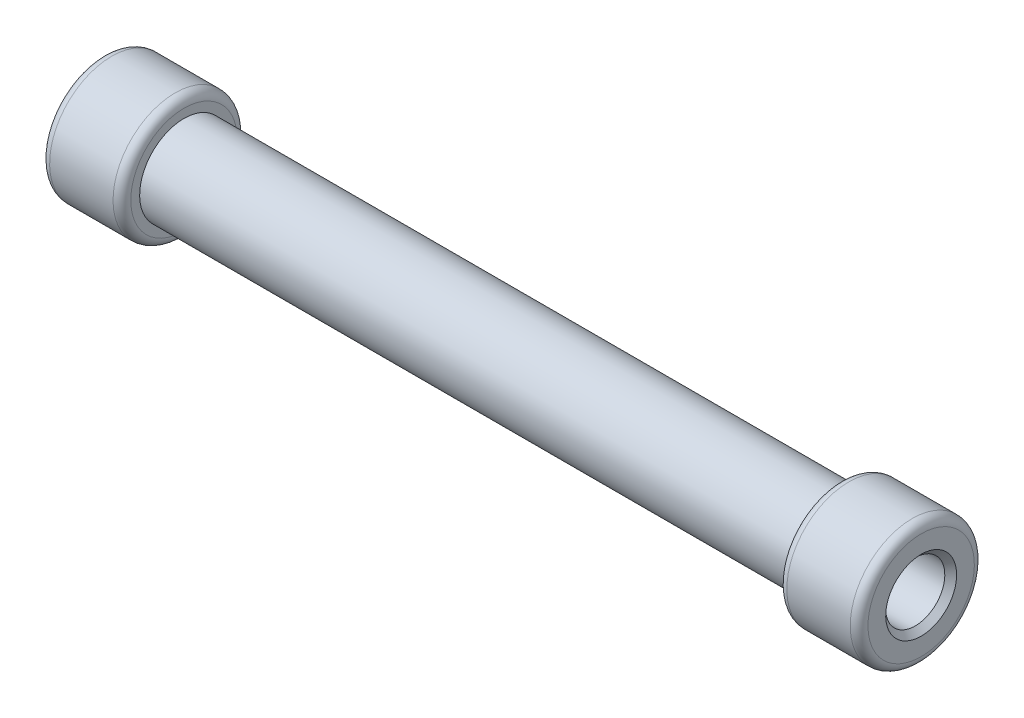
ISO-10303-21;
HEADER;
FILE_DESCRIPTION(('STEP AP214'),'2;1');
FILE_NAME('part.step','',(''),(''),'','','');
FILE_SCHEMA(('AUTOMOTIVE_DESIGN { 1 0 10303 214 1 1 1 1 }'));
ENDSEC;
DATA;
#1=APPLICATION_CONTEXT('core data for automotive mechanical design processes');
#2=APPLICATION_PROTOCOL_DEFINITION('international standard','automotive_design',2000,#1);
#3=PRODUCT_CONTEXT('',#1,'mechanical');
#4=PRODUCT('Part','Part','',(#3));
#5=PRODUCT_RELATED_PRODUCT_CATEGORY('part','',(#4));
#6=PRODUCT_DEFINITION_FORMATION('','',#4);
#7=PRODUCT_DEFINITION_CONTEXT('part definition',#1,'design');
#8=PRODUCT_DEFINITION('design','',#6,#7);
#9=PRODUCT_DEFINITION_SHAPE('','',#8);
#10=(LENGTH_UNIT() NAMED_UNIT(*) SI_UNIT(.MILLI.,.METRE.));
#11=(NAMED_UNIT(*) PLANE_ANGLE_UNIT() SI_UNIT($,.RADIAN.));
#12=(NAMED_UNIT(*) SI_UNIT($,.STERADIAN.) SOLID_ANGLE_UNIT());
#13=UNCERTAINTY_MEASURE_WITH_UNIT(LENGTH_MEASURE(1.E-05),#10,'distance_accuracy_value','');
#14=(GEOMETRIC_REPRESENTATION_CONTEXT(3) GLOBAL_UNCERTAINTY_ASSIGNED_CONTEXT((#13)) GLOBAL_UNIT_ASSIGNED_CONTEXT((#10,
#11,#12)) REPRESENTATION_CONTEXT('',''));
#15=CARTESIAN_POINT('',(0.,0.,0.));
#16=DIRECTION('',(0.,0.,1.));
#17=DIRECTION('',(1.,0.,0.));
#18=AXIS2_PLACEMENT_3D('',#15,#16,#17);
#19=CARTESIAN_POINT('',(48.1,0.,4.33333333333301));
#20=DIRECTION('',(-1.,0.,0.));
#21=DIRECTION('',(0.,-1.,0.));
#22=AXIS2_PLACEMENT_3D('',#19,#20,#21);
#23=PLANE('',#22);
#24=CARTESIAN_POINT('',(48.1,0.,0.));
#25=DIRECTION('',(1.,0.,0.));
#26=DIRECTION('',(0.,1.,0.));
#27=AXIS2_PLACEMENT_3D('',#24,#25,#26);
#28=CIRCLE('',#27,4.333333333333);
#29=CARTESIAN_POINT('',(48.1,4.333333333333,0.));
#30=VERTEX_POINT('',#29);
#31=EDGE_CURVE('E65',#30,#30,#28,.T.);
#32=ORIENTED_EDGE('',*,*,#31,.T.);
#33=EDGE_LOOP('',(#32));
#34=FACE_BOUND('',#33,.T.);
#35=ADVANCED_FACE('F12',(#34),#23,.F.);
#36=CARTESIAN_POINT('',(60.,0.,0.));
#37=DIRECTION('',(1.,0.,0.));
#38=DIRECTION('',(0.,1.,0.));
#39=AXIS2_PLACEMENT_3D('',#36,#37,#38);
#40=CYLINDRICAL_SURFACE('',#39,4.333333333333);
#41=ORIENTED_EDGE('',*,*,#31,.F.);
#42=EDGE_LOOP('',(#41));
#43=FACE_BOUND('',#42,.T.);
#44=CARTESIAN_POINT('',(59.133333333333,0.,0.));
#45=DIRECTION('',(1.,0.,0.));
#46=DIRECTION('',(0.,1.,0.));
#47=AXIS2_PLACEMENT_3D('',#44,#45,#46);
#48=CIRCLE('',#47,4.333333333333);
#49=CARTESIAN_POINT('',(59.133333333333,4.333333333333,0.));
#50=VERTEX_POINT('',#49);
#51=EDGE_CURVE('E62',#50,#50,#48,.T.);
#52=ORIENTED_EDGE('',*,*,#51,.T.);
#53=EDGE_LOOP('',(#52));
#54=FACE_BOUND('',#53,.T.);
#55=ADVANCED_FACE('F70',(#43,#54),#40,.F.);
#56=CARTESIAN_POINT('',(60.,0.,0.));
#57=DIRECTION('',(1.,0.,0.));
#58=DIRECTION('',(0.,1.,0.));
#59=AXIS2_PLACEMENT_3D('',#56,#57,#58);
#60=CONICAL_SURFACE('',#59,5.2,0.785398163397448);
#61=ORIENTED_EDGE('',*,*,#51,.F.);
#62=EDGE_LOOP('',(#61));
#63=FACE_BOUND('',#62,.T.);
#64=CARTESIAN_POINT('',(60.,0.,0.));
#65=DIRECTION('',(1.,0.,0.));
#66=DIRECTION('',(0.,1.,0.));
#67=AXIS2_PLACEMENT_3D('',#64,#65,#66);
#68=CIRCLE('',#67,5.2);
#69=CARTESIAN_POINT('',(60.,5.2,0.));
#70=VERTEX_POINT('',#69);
#71=EDGE_CURVE('E59',#70,#70,#68,.T.);
#72=ORIENTED_EDGE('',*,*,#71,.T.);
#73=EDGE_LOOP('',(#72));
#74=FACE_BOUND('',#73,.T.);
#75=ADVANCED_FACE('F73',(#63,#74),#60,.F.);
#76=CARTESIAN_POINT('',(60.,0.,7.8));
#77=DIRECTION('',(-1.,0.,0.));
#78=DIRECTION('',(0.,-1.,0.));
#79=AXIS2_PLACEMENT_3D('',#76,#77,#78);
#80=PLANE('',#79);
#81=ORIENTED_EDGE('',*,*,#71,.F.);
#82=EDGE_LOOP('',(#81));
#83=FACE_BOUND('',#82,.T.);
#84=CARTESIAN_POINT('',(60.,0.,0.));
#85=DIRECTION('',(1.,0.,0.));
#86=DIRECTION('',(0.,1.,0.));
#87=AXIS2_PLACEMENT_3D('',#84,#85,#86);
#88=CIRCLE('',#87,7.80000000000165);
#89=CARTESIAN_POINT('',(60.,7.80000000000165,0.));
#90=VERTEX_POINT('',#89);
#91=EDGE_CURVE('E56',#90,#90,#88,.T.);
#92=ORIENTED_EDGE('',*,*,#91,.T.);
#93=EDGE_LOOP('',(#92));
#94=FACE_BOUND('',#93,.T.);
#95=ADVANCED_FACE('F79',(#83,#94),#80,.F.);
#96=CARTESIAN_POINT('',(58.7000000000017,0.,0.));
#97=DIRECTION('',(1.,0.,0.));
#98=DIRECTION('',(0.,1.,0.));
#99=AXIS2_PLACEMENT_3D('',#96,#97,#98);
#100=TOROIDAL_SURFACE('',#99,7.80000000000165,1.29999999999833);
#101=CARTESIAN_POINT('',(58.7,0.,0.));
#102=DIRECTION('',(1.,0.,0.));
#103=DIRECTION('',(0.,1.,0.));
#104=AXIS2_PLACEMENT_3D('',#101,#102,#103);
#105=CIRCLE('',#104,9.1);
#106=CARTESIAN_POINT('',(58.7,9.1,0.));
#107=VERTEX_POINT('',#106);
#108=EDGE_CURVE('E53',#107,#107,#105,.T.);
#109=ORIENTED_EDGE('',*,*,#108,.T.);
#110=EDGE_LOOP('',(#109));
#111=FACE_BOUND('',#110,.T.);
#112=ORIENTED_EDGE('',*,*,#91,.F.);
#113=EDGE_LOOP('',(#112));
#114=FACE_BOUND('',#113,.T.);
#115=ADVANCED_FACE('F85',(#111,#114),#100,.T.);
#116=CARTESIAN_POINT('',(60.,0.,0.));
#117=DIRECTION('',(1.,0.,0.));
#118=DIRECTION('',(0.,1.,0.));
#119=AXIS2_PLACEMENT_3D('',#116,#117,#118);
#120=CYLINDRICAL_SURFACE('',#119,9.1);
#121=ORIENTED_EDGE('',*,*,#108,.F.);
#122=EDGE_LOOP('',(#121));
#123=FACE_BOUND('',#122,.T.);
#124=CARTESIAN_POINT('',(49.3999999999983,0.,0.));
#125=DIRECTION('',(1.,0.,0.));
#126=DIRECTION('',(0.,1.,0.));
#127=AXIS2_PLACEMENT_3D('',#124,#125,#126);
#128=CIRCLE('',#127,9.1);
#129=CARTESIAN_POINT('',(49.3999999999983,9.1,0.));
#130=VERTEX_POINT('',#129);
#131=EDGE_CURVE('E50',#130,#130,#128,.T.);
#132=ORIENTED_EDGE('',*,*,#131,.T.);
#133=EDGE_LOOP('',(#132));
#134=FACE_BOUND('',#133,.T.);
#135=ADVANCED_FACE('F90',(#123,#134),#120,.T.);
#136=CARTESIAN_POINT('',(49.3999999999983,0.,0.));
#137=DIRECTION('',(1.,0.,0.));
#138=DIRECTION('',(0.,1.,0.));
#139=AXIS2_PLACEMENT_3D('',#136,#137,#138);
#140=TOROIDAL_SURFACE('',#139,7.80000000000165,1.29999999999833);
#141=CARTESIAN_POINT('',(48.1,0.,0.));
#142=DIRECTION('',(1.,0.,0.));
#143=DIRECTION('',(0.,1.,0.));
#144=AXIS2_PLACEMENT_3D('',#141,#142,#143);
#145=CIRCLE('',#144,7.8);
#146=CARTESIAN_POINT('',(48.1,7.8,0.));
#147=VERTEX_POINT('',#146);
#148=EDGE_CURVE('E47',#147,#147,#145,.T.);
#149=ORIENTED_EDGE('',*,*,#148,.T.);
#150=EDGE_LOOP('',(#149));
#151=FACE_BOUND('',#150,.T.);
#152=ORIENTED_EDGE('',*,*,#131,.F.);
#153=EDGE_LOOP('',(#152));
#154=FACE_BOUND('',#153,.T.);
#155=ADVANCED_FACE('F98',(#151,#154),#140,.T.);
#156=CARTESIAN_POINT('',(48.1,0.,6.5));
#157=DIRECTION('',(1.,0.,0.));
#158=DIRECTION('',(0.,1.,0.));
#159=AXIS2_PLACEMENT_3D('',#156,#157,#158);
#160=PLANE('',#159);
#161=ORIENTED_EDGE('',*,*,#148,.F.);
#162=EDGE_LOOP('',(#161));
#163=FACE_BOUND('',#162,.T.);
#164=CARTESIAN_POINT('',(48.1,0.,0.));
#165=DIRECTION('',(1.,0.,0.));
#166=DIRECTION('',(0.,1.,0.));
#167=AXIS2_PLACEMENT_3D('',#164,#165,#166);
#168=CIRCLE('',#167,6.5);
#169=CARTESIAN_POINT('',(48.1,6.5,0.));
#170=VERTEX_POINT('',#169);
#171=EDGE_CURVE('E44',#170,#170,#168,.T.);
#172=ORIENTED_EDGE('',*,*,#171,.T.);
#173=EDGE_LOOP('',(#172));
#174=FACE_BOUND('',#173,.T.);
#175=ADVANCED_FACE('F145',(#163,#174),#160,.F.);
#176=CARTESIAN_POINT('',(-48.1,0.,0.));
#177=DIRECTION('',(1.,0.,0.));
#178=DIRECTION('',(0.,1.,0.));
#179=AXIS2_PLACEMENT_3D('',#176,#177,#178);
#180=PLANE('',#179);
#181=CARTESIAN_POINT('',(-48.1,0.,0.));
#182=DIRECTION('',(1.,0.,0.));
#183=DIRECTION('',(0.,1.,0.));
#184=AXIS2_PLACEMENT_3D('',#181,#182,#183);
#185=CIRCLE('',#184,4.333333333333);
#186=CARTESIAN_POINT('',(-48.1,4.333333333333,0.));
#187=VERTEX_POINT('',#186);
#188=EDGE_CURVE('E8',#187,#187,#185,.T.);
#189=ORIENTED_EDGE('',*,*,#188,.F.);
#190=EDGE_LOOP('',(#189));
#191=FACE_BOUND('',#190,.T.);
#192=ADVANCED_FACE('F14',(#191),#180,.F.);
#193=CARTESIAN_POINT('',(60.,0.,0.));
#194=DIRECTION('',(1.,0.,0.));
#195=DIRECTION('',(0.,1.,0.));
#196=AXIS2_PLACEMENT_3D('',#193,#194,#195);
#197=CYLINDRICAL_SURFACE('',#196,4.333333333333);
#198=CARTESIAN_POINT('',(-59.133333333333,0.,0.));
#199=DIRECTION('',(1.,0.,0.));
#200=DIRECTION('',(0.,1.,0.));
#201=AXIS2_PLACEMENT_3D('',#198,#199,#200);
#202=CIRCLE('',#201,4.333333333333);
#203=CARTESIAN_POINT('',(-59.133333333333,4.333333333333,0.));
#204=VERTEX_POINT('',#203);
#205=EDGE_CURVE('E19',#204,#204,#202,.T.);
#206=ORIENTED_EDGE('',*,*,#205,.F.);
#207=EDGE_LOOP('',(#206));
#208=FACE_BOUND('',#207,.T.);
#209=ORIENTED_EDGE('',*,*,#188,.T.);
#210=EDGE_LOOP('',(#209));
#211=FACE_BOUND('',#210,.T.);
#212=ADVANCED_FACE('F161',(#208,#211),#197,.F.);
#213=CARTESIAN_POINT('',(-59.133333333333,0.,0.));
#214=DIRECTION('',(-1.,0.,0.));
#215=DIRECTION('',(0.,-1.,0.));
#216=AXIS2_PLACEMENT_3D('',#213,#214,#215);
#217=CONICAL_SURFACE('',#216,4.333333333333,0.785398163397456);
#218=CARTESIAN_POINT('',(-60.,0.,0.));
#219=DIRECTION('',(1.,0.,0.));
#220=DIRECTION('',(0.,1.,0.));
#221=AXIS2_PLACEMENT_3D('',#218,#219,#220);
#222=CIRCLE('',#221,5.2);
#223=CARTESIAN_POINT('',(-60.,5.2,0.));
#224=VERTEX_POINT('',#223);
#225=EDGE_CURVE('E23',#224,#224,#222,.T.);
#226=ORIENTED_EDGE('',*,*,#225,.F.);
#227=EDGE_LOOP('',(#226));
#228=FACE_BOUND('',#227,.T.);
#229=ORIENTED_EDGE('',*,*,#205,.T.);
#230=EDGE_LOOP('',(#229));
#231=FACE_BOUND('',#230,.T.);
#232=ADVANCED_FACE('F169',(#228,#231),#217,.F.);
#233=CARTESIAN_POINT('',(-60.,0.,5.2));
#234=DIRECTION('',(1.,0.,0.));
#235=DIRECTION('',(0.,1.,0.));
#236=AXIS2_PLACEMENT_3D('',#233,#234,#235);
#237=PLANE('',#236);
#238=CARTESIAN_POINT('',(-60.,0.,0.));
#239=DIRECTION('',(1.,0.,0.));
#240=DIRECTION('',(0.,1.,0.));
#241=AXIS2_PLACEMENT_3D('',#238,#239,#240);
#242=CIRCLE('',#241,7.8);
#243=CARTESIAN_POINT('',(-60.,7.8,0.));
#244=VERTEX_POINT('',#243);
#245=EDGE_CURVE('E27',#244,#244,#242,.T.);
#246=ORIENTED_EDGE('',*,*,#245,.F.);
#247=EDGE_LOOP('',(#246));
#248=FACE_BOUND('',#247,.T.);
#249=ORIENTED_EDGE('',*,*,#225,.T.);
#250=EDGE_LOOP('',(#249));
#251=FACE_BOUND('',#250,.T.);
#252=ADVANCED_FACE('F177',(#248,#251),#237,.F.);
#253=CARTESIAN_POINT('',(-58.7000000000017,0.,0.));
#254=DIRECTION('',(1.,0.,0.));
#255=DIRECTION('',(0.,1.,0.));
#256=AXIS2_PLACEMENT_3D('',#253,#254,#255);
#257=TOROIDAL_SURFACE('',#256,7.80000000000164,1.29999999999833);
#258=ORIENTED_EDGE('',*,*,#245,.T.);
#259=EDGE_LOOP('',(#258));
#260=FACE_BOUND('',#259,.T.);
#261=CARTESIAN_POINT('',(-58.7000000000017,0.,0.));
#262=DIRECTION('',(1.,0.,0.));
#263=DIRECTION('',(0.,1.,0.));
#264=AXIS2_PLACEMENT_3D('',#261,#262,#263);
#265=CIRCLE('',#264,9.1);
#266=CARTESIAN_POINT('',(-58.7000000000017,9.1,0.));
#267=VERTEX_POINT('',#266);
#268=EDGE_CURVE('E32',#267,#267,#265,.T.);
#269=ORIENTED_EDGE('',*,*,#268,.F.);
#270=EDGE_LOOP('',(#269));
#271=FACE_BOUND('',#270,.T.);
#272=ADVANCED_FACE('F186',(#260,#271),#257,.T.);
#273=CARTESIAN_POINT('',(60.,0.,0.));
#274=DIRECTION('',(1.,0.,0.));
#275=DIRECTION('',(0.,1.,0.));
#276=AXIS2_PLACEMENT_3D('',#273,#274,#275);
#277=CYLINDRICAL_SURFACE('',#276,9.1);
#278=CARTESIAN_POINT('',(-49.4,0.,0.));
#279=DIRECTION('',(1.,0.,0.));
#280=DIRECTION('',(0.,1.,0.));
#281=AXIS2_PLACEMENT_3D('',#278,#279,#280);
#282=CIRCLE('',#281,9.1);
#283=CARTESIAN_POINT('',(-49.4,9.1,0.));
#284=VERTEX_POINT('',#283);
#285=EDGE_CURVE('E35',#284,#284,#282,.T.);
#286=ORIENTED_EDGE('',*,*,#285,.F.);
#287=EDGE_LOOP('',(#286));
#288=FACE_BOUND('',#287,.T.);
#289=ORIENTED_EDGE('',*,*,#268,.T.);
#290=EDGE_LOOP('',(#289));
#291=FACE_BOUND('',#290,.T.);
#292=ADVANCED_FACE('F195',(#288,#291),#277,.T.);
#293=CARTESIAN_POINT('',(-49.4,0.,0.));
#294=DIRECTION('',(1.,0.,0.));
#295=DIRECTION('',(0.,1.,0.));
#296=AXIS2_PLACEMENT_3D('',#293,#294,#295);
#297=TOROIDAL_SURFACE('',#296,7.8,1.3);
#298=ORIENTED_EDGE('',*,*,#285,.T.);
#299=EDGE_LOOP('',(#298));
#300=FACE_BOUND('',#299,.T.);
#301=CARTESIAN_POINT('',(-48.1,0.,0.));
#302=DIRECTION('',(1.,0.,0.));
#303=DIRECTION('',(0.,1.,0.));
#304=AXIS2_PLACEMENT_3D('',#301,#302,#303);
#305=CIRCLE('',#304,7.8);
#306=CARTESIAN_POINT('',(-48.1,7.8,0.));
#307=VERTEX_POINT('',#306);
#308=EDGE_CURVE('E38',#307,#307,#305,.T.);
#309=ORIENTED_EDGE('',*,*,#308,.F.);
#310=EDGE_LOOP('',(#309));
#311=FACE_BOUND('',#310,.T.);
#312=ADVANCED_FACE('F204',(#300,#311),#297,.T.);
#313=CARTESIAN_POINT('',(-48.1,0.,7.8));
#314=DIRECTION('',(-1.,0.,0.));
#315=DIRECTION('',(0.,-1.,0.));
#316=AXIS2_PLACEMENT_3D('',#313,#314,#315);
#317=PLANE('',#316);
#318=CARTESIAN_POINT('',(-48.1,0.,0.));
#319=DIRECTION('',(1.,0.,0.));
#320=DIRECTION('',(0.,1.,0.));
#321=AXIS2_PLACEMENT_3D('',#318,#319,#320);
#322=CIRCLE('',#321,6.5);
#323=CARTESIAN_POINT('',(-48.1,6.5,0.));
#324=VERTEX_POINT('',#323);
#325=EDGE_CURVE('E41',#324,#324,#322,.T.);
#326=ORIENTED_EDGE('',*,*,#325,.F.);
#327=EDGE_LOOP('',(#326));
#328=FACE_BOUND('',#327,.T.);
#329=ORIENTED_EDGE('',*,*,#308,.T.);
#330=EDGE_LOOP('',(#329));
#331=FACE_BOUND('',#330,.T.);
#332=ADVANCED_FACE('F213',(#328,#331),#317,.F.);
#333=CARTESIAN_POINT('',(60.,0.,0.));
#334=DIRECTION('',(1.,0.,0.));
#335=DIRECTION('',(0.,1.,0.));
#336=AXIS2_PLACEMENT_3D('',#333,#334,#335);
#337=CYLINDRICAL_SURFACE('',#336,6.5);
#338=ORIENTED_EDGE('',*,*,#325,.T.);
#339=EDGE_LOOP('',(#338));
#340=FACE_BOUND('',#339,.T.);
#341=ORIENTED_EDGE('',*,*,#171,.F.);
#342=EDGE_LOOP('',(#341));
#343=FACE_BOUND('',#342,.T.);
#344=ADVANCED_FACE('F222',(#340,#343),#337,.T.);
#345=CLOSED_SHELL('',(#35,#55,#75,#95,#115,#135,#155,#175,#192,#212,#232,#252,#272,#292,#312,
#332,#344));
#346=MANIFOLD_SOLID_BREP('B1',#345);
#347=ADVANCED_BREP_SHAPE_REPRESENTATION('',(#18,#346),#14);
#348=SHAPE_DEFINITION_REPRESENTATION(#9,#347);
ENDSEC;
END-ISO-10303-21;
